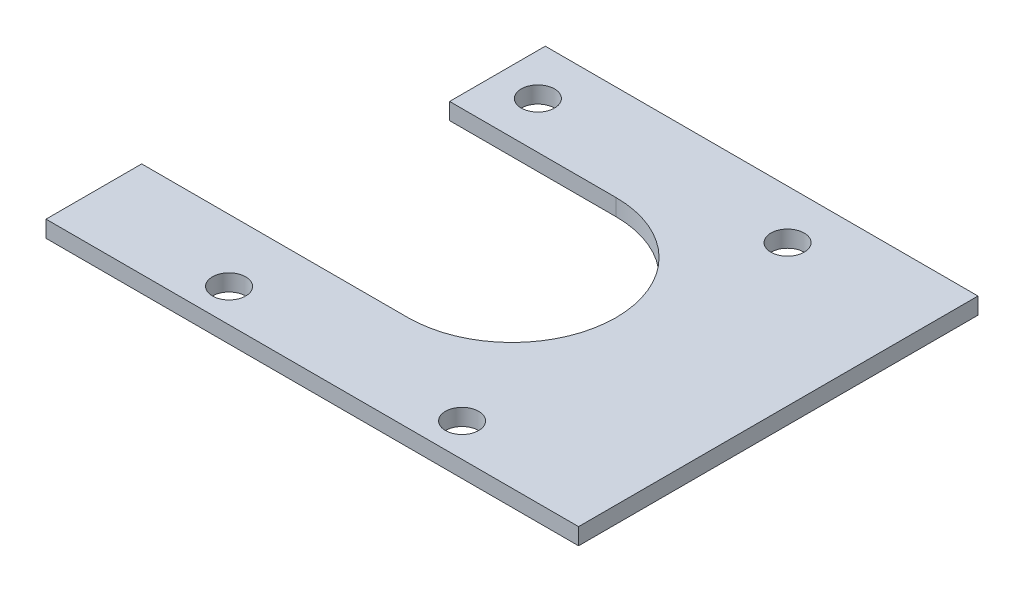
ISO-10303-21;
HEADER;
FILE_DESCRIPTION(('STEP AP214'),'2;1');
FILE_NAME('part.step','',(''),(''),'','','');
FILE_SCHEMA(('AUTOMOTIVE_DESIGN { 1 0 10303 214 1 1 1 1 }'));
ENDSEC;
DATA;
#1=APPLICATION_CONTEXT('core data for automotive mechanical design processes');
#2=APPLICATION_PROTOCOL_DEFINITION('international standard','automotive_design',2000,#1);
#3=PRODUCT_CONTEXT('',#1,'mechanical');
#4=PRODUCT('Part','Part','',(#3));
#5=PRODUCT_RELATED_PRODUCT_CATEGORY('part','',(#4));
#6=PRODUCT_DEFINITION_FORMATION('','',#4);
#7=PRODUCT_DEFINITION_CONTEXT('part definition',#1,'design');
#8=PRODUCT_DEFINITION('design','',#6,#7);
#9=PRODUCT_DEFINITION_SHAPE('','',#8);
#10=(LENGTH_UNIT() NAMED_UNIT(*) SI_UNIT(.MILLI.,.METRE.));
#11=(NAMED_UNIT(*) PLANE_ANGLE_UNIT() SI_UNIT($,.RADIAN.));
#12=(NAMED_UNIT(*) SI_UNIT($,.STERADIAN.) SOLID_ANGLE_UNIT());
#13=UNCERTAINTY_MEASURE_WITH_UNIT(LENGTH_MEASURE(1.E-05),#10,'distance_accuracy_value','');
#14=(GEOMETRIC_REPRESENTATION_CONTEXT(3) GLOBAL_UNCERTAINTY_ASSIGNED_CONTEXT((#13)) GLOBAL_UNIT_ASSIGNED_CONTEXT((#10,
#11,#12)) REPRESENTATION_CONTEXT('',''));
#15=CARTESIAN_POINT('',(0.,0.,0.));
#16=DIRECTION('',(0.,0.,1.));
#17=DIRECTION('',(1.,0.,0.));
#18=AXIS2_PLACEMENT_3D('',#15,#16,#17);
#19=CARTESIAN_POINT('',(25.4,1.5875,-19.05));
#20=DIRECTION('',(-1.,0.,0.));
#21=DIRECTION('',(0.,0.,1.));
#22=AXIS2_PLACEMENT_3D('',#19,#20,#21);
#23=PLANE('',#22);
#24=DIRECTION('',(0.,0.,-1.));
#25=VECTOR('',#24,1.);
#26=CARTESIAN_POINT('',(25.4,1.5875,-19.05));
#27=LINE('',#26,#25);
#28=CARTESIAN_POINT('',(25.4,1.5875,19.0499999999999));
#29=VERTEX_POINT('',#28);
#30=CARTESIAN_POINT('',(25.4,1.5875,-19.05));
#31=VERTEX_POINT('',#30);
#32=EDGE_CURVE('E93',#29,#31,#27,.T.);
#33=ORIENTED_EDGE('',*,*,#32,.F.);
#34=DIRECTION('',(0.,-1.,0.));
#35=VECTOR('',#34,1.);
#36=CARTESIAN_POINT('',(25.4,1.5875,19.0499999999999));
#37=LINE('',#36,#35);
#38=CARTESIAN_POINT('',(25.4,0.,19.0499999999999));
#39=VERTEX_POINT('',#38);
#40=EDGE_CURVE('E165',#29,#39,#37,.T.);
#41=ORIENTED_EDGE('',*,*,#40,.T.);
#42=DIRECTION('',(0.,0.,-1.));
#43=VECTOR('',#42,1.);
#44=CARTESIAN_POINT('',(25.4,0.,-19.05));
#45=LINE('',#44,#43);
#46=CARTESIAN_POINT('',(25.4,0.,-19.05));
#47=VERTEX_POINT('',#46);
#48=EDGE_CURVE('E134',#39,#47,#45,.T.);
#49=ORIENTED_EDGE('',*,*,#48,.T.);
#50=DIRECTION('',(0.,-1.,0.));
#51=VECTOR('',#50,1.);
#52=CARTESIAN_POINT('',(25.4,1.5875,-19.05));
#53=LINE('',#52,#51);
#54=EDGE_CURVE('E43',#31,#47,#53,.T.);
#55=ORIENTED_EDGE('',*,*,#54,.F.);
#56=EDGE_LOOP('',(#33,#41,#49,#55));
#57=FACE_BOUND('',#56,.T.);
#58=ADVANCED_FACE('F36',(#57),#23,.F.);
#59=CARTESIAN_POINT('',(25.4,1.5875,-19.05));
#60=DIRECTION('',(0.,0.,1.));
#61=DIRECTION('',(1.,0.,0.));
#62=AXIS2_PLACEMENT_3D('',#59,#60,#61);
#63=PLANE('',#62);
#64=DIRECTION('',(-1.,0.,0.));
#65=VECTOR('',#64,1.);
#66=CARTESIAN_POINT('',(25.4,0.,-19.05));
#67=LINE('',#66,#65);
#68=CARTESIAN_POINT('',(-15.875,0.,-19.05));
#69=VERTEX_POINT('',#68);
#70=EDGE_CURVE('E136',#47,#69,#67,.T.);
#71=ORIENTED_EDGE('',*,*,#70,.T.);
#72=DIRECTION('',(0.,-1.,0.));
#73=VECTOR('',#72,1.);
#74=CARTESIAN_POINT('',(-15.875,1.5875,-19.05));
#75=LINE('',#74,#73);
#76=CARTESIAN_POINT('',(-15.875,1.5875,-19.05));
#77=VERTEX_POINT('',#76);
#78=EDGE_CURVE('E151',#77,#69,#75,.T.);
#79=ORIENTED_EDGE('',*,*,#78,.F.);
#80=DIRECTION('',(-1.,0.,0.));
#81=VECTOR('',#80,1.);
#82=CARTESIAN_POINT('',(25.4,1.5875,-19.05));
#83=LINE('',#82,#81);
#84=EDGE_CURVE('E159',#31,#77,#83,.T.);
#85=ORIENTED_EDGE('',*,*,#84,.F.);
#86=ORIENTED_EDGE('',*,*,#54,.T.);
#87=EDGE_LOOP('',(#71,#79,#85,#86));
#88=FACE_BOUND('',#87,.T.);
#89=ADVANCED_FACE('F156',(#88),#63,.F.);
#90=CARTESIAN_POINT('',(-15.875,1.5875,-9.921875));
#91=DIRECTION('',(1.,0.,0.));
#92=DIRECTION('',(0.,0.,-1.));
#93=AXIS2_PLACEMENT_3D('',#90,#91,#92);
#94=PLANE('',#93);
#95=DIRECTION('',(0.,0.,1.));
#96=VECTOR('',#95,1.);
#97=CARTESIAN_POINT('',(-15.875,0.,-9.921875));
#98=LINE('',#97,#96);
#99=CARTESIAN_POINT('',(-15.875,0.,-9.921875));
#100=VERTEX_POINT('',#99);
#101=EDGE_CURVE('E139',#69,#100,#98,.T.);
#102=ORIENTED_EDGE('',*,*,#101,.T.);
#103=DIRECTION('',(0.,-1.,0.));
#104=VECTOR('',#103,1.);
#105=CARTESIAN_POINT('',(-15.875,1.5875,-9.921875));
#106=LINE('',#105,#104);
#107=CARTESIAN_POINT('',(-15.875,1.5875,-9.921875));
#108=VERTEX_POINT('',#107);
#109=EDGE_CURVE('E123',#108,#100,#106,.T.);
#110=ORIENTED_EDGE('',*,*,#109,.F.);
#111=DIRECTION('',(0.,0.,1.));
#112=VECTOR('',#111,1.);
#113=CARTESIAN_POINT('',(-15.875,1.5875,-9.921875));
#114=LINE('',#113,#112);
#115=EDGE_CURVE('E111',#77,#108,#114,.T.);
#116=ORIENTED_EDGE('',*,*,#115,.F.);
#117=ORIENTED_EDGE('',*,*,#78,.T.);
#118=EDGE_LOOP('',(#102,#110,#116,#117));
#119=FACE_BOUND('',#118,.T.);
#120=ADVANCED_FACE('F170',(#119),#94,.F.);
#121=CARTESIAN_POINT('',(0.,1.5875,-9.921875));
#122=DIRECTION('',(0.,0.,-1.));
#123=DIRECTION('',(-1.,0.,0.));
#124=AXIS2_PLACEMENT_3D('',#121,#122,#123);
#125=PLANE('',#124);
#126=DIRECTION('',(1.,0.,0.));
#127=VECTOR('',#126,1.);
#128=CARTESIAN_POINT('',(0.,0.,-9.921875));
#129=LINE('',#128,#127);
#130=CARTESIAN_POINT('',(0.,0.,-9.921875));
#131=VERTEX_POINT('',#130);
#132=EDGE_CURVE('E121',#100,#131,#129,.T.);
#133=ORIENTED_EDGE('',*,*,#132,.T.);
#134=DIRECTION('',(0.,-1.,0.));
#135=VECTOR('',#134,1.);
#136=CARTESIAN_POINT('',(0.,1.5875,-9.921875));
#137=LINE('',#136,#135);
#138=CARTESIAN_POINT('',(0.,1.5875,-9.921875));
#139=VERTEX_POINT('',#138);
#140=EDGE_CURVE('E118',#139,#131,#137,.T.);
#141=ORIENTED_EDGE('',*,*,#140,.F.);
#142=DIRECTION('',(1.,0.,0.));
#143=VECTOR('',#142,1.);
#144=CARTESIAN_POINT('',(0.,1.5875,-9.921875));
#145=LINE('',#144,#143);
#146=EDGE_CURVE('E103',#108,#139,#145,.T.);
#147=ORIENTED_EDGE('',*,*,#146,.F.);
#148=ORIENTED_EDGE('',*,*,#109,.T.);
#149=EDGE_LOOP('',(#133,#141,#147,#148));
#150=FACE_BOUND('',#149,.T.);
#151=ADVANCED_FACE('F119',(#150),#125,.F.);
#152=CARTESIAN_POINT('',(0.,1.5875,0.));
#153=DIRECTION('',(0.,-1.,0.));
#154=DIRECTION('',(0.,0.,-1.));
#155=AXIS2_PLACEMENT_3D('',#152,#153,#154);
#156=CYLINDRICAL_SURFACE('',#155,9.921875);
#157=CARTESIAN_POINT('',(0.,0.,0.));
#158=DIRECTION('',(0.,-1.,0.));
#159=DIRECTION('',(0.,0.,1.));
#160=AXIS2_PLACEMENT_3D('',#157,#158,#159);
#161=CIRCLE('',#160,9.921875);
#162=CARTESIAN_POINT('',(0.,0.,9.921875));
#163=VERTEX_POINT('',#162);
#164=EDGE_CURVE('E142',#131,#163,#161,.T.);
#165=ORIENTED_EDGE('',*,*,#164,.T.);
#166=DIRECTION('',(0.,-1.,0.));
#167=VECTOR('',#166,1.);
#168=CARTESIAN_POINT('',(0.,1.5875,9.921875));
#169=LINE('',#168,#167);
#170=CARTESIAN_POINT('',(0.,1.5875,9.921875));
#171=VERTEX_POINT('',#170);
#172=EDGE_CURVE('E124',#171,#163,#169,.T.);
#173=ORIENTED_EDGE('',*,*,#172,.F.);
#174=CARTESIAN_POINT('',(0.,1.5875,0.));
#175=DIRECTION('',(0.,-1.,0.));
#176=DIRECTION('',(0.,0.,1.));
#177=AXIS2_PLACEMENT_3D('',#174,#175,#176);
#178=CIRCLE('',#177,9.921875);
#179=EDGE_CURVE('E108',#139,#171,#178,.T.);
#180=ORIENTED_EDGE('',*,*,#179,.F.);
#181=ORIENTED_EDGE('',*,*,#140,.T.);
#182=EDGE_LOOP('',(#165,#173,#180,#181));
#183=FACE_BOUND('',#182,.T.);
#184=ADVANCED_FACE('F126',(#183),#156,.F.);
#185=CARTESIAN_POINT('',(0.,1.5875,9.921875));
#186=DIRECTION('',(0.,0.,1.));
#187=DIRECTION('',(1.,0.,0.));
#188=AXIS2_PLACEMENT_3D('',#185,#186,#187);
#189=PLANE('',#188);
#190=DIRECTION('',(-1.,0.,0.));
#191=VECTOR('',#190,1.);
#192=CARTESIAN_POINT('',(0.,0.,9.921875));
#193=LINE('',#192,#191);
#194=CARTESIAN_POINT('',(-25.4,0.,9.92187500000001));
#195=VERTEX_POINT('',#194);
#196=EDGE_CURVE('E85',#163,#195,#193,.T.);
#197=ORIENTED_EDGE('',*,*,#196,.T.);
#198=DIRECTION('',(0.,-1.,0.));
#199=VECTOR('',#198,1.);
#200=CARTESIAN_POINT('',(-25.4,1.5875,9.92187500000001));
#201=LINE('',#200,#199);
#202=CARTESIAN_POINT('',(-25.4,1.5875,9.92187500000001));
#203=VERTEX_POINT('',#202);
#204=EDGE_CURVE('E133',#203,#195,#201,.T.);
#205=ORIENTED_EDGE('',*,*,#204,.F.);
#206=DIRECTION('',(-1.,0.,0.));
#207=VECTOR('',#206,1.);
#208=CARTESIAN_POINT('',(0.,1.5875,9.921875));
#209=LINE('',#208,#207);
#210=EDGE_CURVE('E58',#171,#203,#209,.T.);
#211=ORIENTED_EDGE('',*,*,#210,.F.);
#212=ORIENTED_EDGE('',*,*,#172,.T.);
#213=EDGE_LOOP('',(#197,#205,#211,#212));
#214=FACE_BOUND('',#213,.T.);
#215=ADVANCED_FACE('F206',(#214),#189,.F.);
#216=CARTESIAN_POINT('',(-25.4,1.5875,9.92187500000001));
#217=DIRECTION('',(1.,0.,0.));
#218=DIRECTION('',(0.,0.,-1.));
#219=AXIS2_PLACEMENT_3D('',#216,#217,#218);
#220=PLANE('',#219);
#221=DIRECTION('',(0.,0.,1.));
#222=VECTOR('',#221,1.);
#223=CARTESIAN_POINT('',(-25.4,0.,9.92187500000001));
#224=LINE('',#223,#222);
#225=CARTESIAN_POINT('',(-25.4,0.,19.0499999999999));
#226=VERTEX_POINT('',#225);
#227=EDGE_CURVE('E145',#195,#226,#224,.T.);
#228=ORIENTED_EDGE('',*,*,#227,.T.);
#229=DIRECTION('',(0.,1.,0.));
#230=VECTOR('',#229,1.);
#231=CARTESIAN_POINT('',(-25.4,1.5875,19.0499999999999));
#232=LINE('',#231,#230);
#233=CARTESIAN_POINT('',(-25.4,1.5875,19.0499999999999));
#234=VERTEX_POINT('',#233);
#235=EDGE_CURVE('E50',#226,#234,#232,.T.);
#236=ORIENTED_EDGE('',*,*,#235,.T.);
#237=DIRECTION('',(0.,0.,1.));
#238=VECTOR('',#237,1.);
#239=CARTESIAN_POINT('',(-25.4,1.5875,9.92187500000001));
#240=LINE('',#239,#238);
#241=EDGE_CURVE('E128',#203,#234,#240,.T.);
#242=ORIENTED_EDGE('',*,*,#241,.F.);
#243=ORIENTED_EDGE('',*,*,#204,.T.);
#244=EDGE_LOOP('',(#228,#236,#242,#243));
#245=FACE_BOUND('',#244,.T.);
#246=ADVANCED_FACE('F204',(#245),#220,.F.);
#247=CARTESIAN_POINT('',(0.,1.5875,0.));
#248=DIRECTION('',(0.,1.,0.));
#249=DIRECTION('',(0.,0.,1.));
#250=AXIS2_PLACEMENT_3D('',#247,#248,#249);
#251=PLANE('',#250);
#252=DIRECTION('',(-1.,0.,0.));
#253=VECTOR('',#252,1.);
#254=CARTESIAN_POINT('',(31.7053948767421,1.5875,19.0499999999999));
#255=LINE('',#254,#253);
#256=EDGE_CURVE('E199',#29,#234,#255,.T.);
#257=ORIENTED_EDGE('',*,*,#256,.F.);
#258=ORIENTED_EDGE('',*,*,#32,.T.);
#259=ORIENTED_EDGE('',*,*,#84,.T.);
#260=ORIENTED_EDGE('',*,*,#115,.T.);
#261=ORIENTED_EDGE('',*,*,#146,.T.);
#262=ORIENTED_EDGE('',*,*,#179,.T.);
#263=ORIENTED_EDGE('',*,*,#210,.T.);
#264=ORIENTED_EDGE('',*,*,#241,.T.);
#265=EDGE_LOOP('',(#257,#258,#259,#260,#261,#262,#263,#264));
#266=FACE_BOUND('',#265,.T.);
#267=CARTESIAN_POINT('',(-11.1125,1.5875,15.875));
#268=DIRECTION('',(0.,1.,0.));
#269=DIRECTION('',(0.,0.,1.));
#270=AXIS2_PLACEMENT_3D('',#267,#268,#269);
#271=CIRCLE('',#270,1.5875);
#272=CARTESIAN_POINT('',(-11.1125,1.5875,17.4625));
#273=VERTEX_POINT('',#272);
#274=EDGE_CURVE('E192',#273,#273,#271,.T.);
#275=ORIENTED_EDGE('',*,*,#274,.F.);
#276=EDGE_LOOP('',(#275));
#277=FACE_BOUND('',#276,.T.);
#278=CARTESIAN_POINT('',(11.1125,1.5875,15.875));
#279=DIRECTION('',(0.,1.,0.));
#280=DIRECTION('',(0.,0.,1.));
#281=AXIS2_PLACEMENT_3D('',#278,#279,#280);
#282=CIRCLE('',#281,1.5875);
#283=CARTESIAN_POINT('',(11.1125,1.5875,17.4625));
#284=VERTEX_POINT('',#283);
#285=EDGE_CURVE('E186',#284,#284,#282,.T.);
#286=ORIENTED_EDGE('',*,*,#285,.F.);
#287=EDGE_LOOP('',(#286));
#288=FACE_BOUND('',#287,.T.);
#289=CARTESIAN_POINT('',(-11.90625,1.5875,-14.3764));
#290=DIRECTION('',(0.,1.,0.));
#291=DIRECTION('',(0.,0.,1.));
#292=AXIS2_PLACEMENT_3D('',#289,#290,#291);
#293=CIRCLE('',#292,1.5875);
#294=CARTESIAN_POINT('',(-11.90625,1.5875,-12.7889));
#295=VERTEX_POINT('',#294);
#296=EDGE_CURVE('E180',#295,#295,#293,.T.);
#297=ORIENTED_EDGE('',*,*,#296,.F.);
#298=EDGE_LOOP('',(#297));
#299=FACE_BOUND('',#298,.T.);
#300=CARTESIAN_POINT('',(11.90625,1.5875,-14.3764));
#301=DIRECTION('',(0.,1.,0.));
#302=DIRECTION('',(0.,0.,1.));
#303=AXIS2_PLACEMENT_3D('',#300,#301,#302);
#304=CIRCLE('',#303,1.5875);
#305=CARTESIAN_POINT('',(11.90625,1.5875,-12.7889));
#306=VERTEX_POINT('',#305);
#307=EDGE_CURVE('E174',#306,#306,#304,.T.);
#308=ORIENTED_EDGE('',*,*,#307,.F.);
#309=EDGE_LOOP('',(#308));
#310=FACE_BOUND('',#309,.T.);
#311=ADVANCED_FACE('F105',(#266,#277,#288,#299,#310),#251,.T.);
#312=CARTESIAN_POINT('',(0.,0.,0.));
#313=DIRECTION('',(0.,1.,0.));
#314=DIRECTION('',(0.,0.,1.));
#315=AXIS2_PLACEMENT_3D('',#312,#313,#314);
#316=PLANE('',#315);
#317=CARTESIAN_POINT('',(-11.1125,0.,15.875));
#318=DIRECTION('',(0.,1.,0.));
#319=DIRECTION('',(0.,0.,1.));
#320=AXIS2_PLACEMENT_3D('',#317,#318,#319);
#321=CIRCLE('',#320,1.5875);
#322=CARTESIAN_POINT('',(-11.1125,0.,17.4625));
#323=VERTEX_POINT('',#322);
#324=EDGE_CURVE('E189',#323,#323,#321,.T.);
#325=ORIENTED_EDGE('',*,*,#324,.T.);
#326=EDGE_LOOP('',(#325));
#327=FACE_BOUND('',#326,.T.);
#328=CARTESIAN_POINT('',(11.1125,0.,15.875));
#329=DIRECTION('',(0.,1.,0.));
#330=DIRECTION('',(0.,0.,1.));
#331=AXIS2_PLACEMENT_3D('',#328,#329,#330);
#332=CIRCLE('',#331,1.5875);
#333=CARTESIAN_POINT('',(11.1125,0.,17.4625));
#334=VERTEX_POINT('',#333);
#335=EDGE_CURVE('E183',#334,#334,#332,.T.);
#336=ORIENTED_EDGE('',*,*,#335,.T.);
#337=EDGE_LOOP('',(#336));
#338=FACE_BOUND('',#337,.T.);
#339=CARTESIAN_POINT('',(-11.90625,0.,-14.3764));
#340=DIRECTION('',(0.,1.,0.));
#341=DIRECTION('',(0.,0.,1.));
#342=AXIS2_PLACEMENT_3D('',#339,#340,#341);
#343=CIRCLE('',#342,1.5875);
#344=CARTESIAN_POINT('',(-11.90625,0.,-12.7889));
#345=VERTEX_POINT('',#344);
#346=EDGE_CURVE('E177',#345,#345,#343,.T.);
#347=ORIENTED_EDGE('',*,*,#346,.T.);
#348=EDGE_LOOP('',(#347));
#349=FACE_BOUND('',#348,.T.);
#350=CARTESIAN_POINT('',(11.90625,0.,-14.3764));
#351=DIRECTION('',(0.,1.,0.));
#352=DIRECTION('',(0.,0.,1.));
#353=AXIS2_PLACEMENT_3D('',#350,#351,#352);
#354=CIRCLE('',#353,1.5875);
#355=CARTESIAN_POINT('',(11.90625,0.,-12.7889));
#356=VERTEX_POINT('',#355);
#357=EDGE_CURVE('E137',#356,#356,#354,.T.);
#358=ORIENTED_EDGE('',*,*,#357,.T.);
#359=EDGE_LOOP('',(#358));
#360=FACE_BOUND('',#359,.T.);
#361=ORIENTED_EDGE('',*,*,#48,.F.);
#362=DIRECTION('',(-1.,0.,0.));
#363=VECTOR('',#362,1.);
#364=CARTESIAN_POINT('',(0.,0.,19.0499999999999));
#365=LINE('',#364,#363);
#366=EDGE_CURVE('E11',#39,#226,#365,.T.);
#367=ORIENTED_EDGE('',*,*,#366,.T.);
#368=ORIENTED_EDGE('',*,*,#227,.F.);
#369=ORIENTED_EDGE('',*,*,#196,.F.);
#370=ORIENTED_EDGE('',*,*,#164,.F.);
#371=ORIENTED_EDGE('',*,*,#132,.F.);
#372=ORIENTED_EDGE('',*,*,#101,.F.);
#373=ORIENTED_EDGE('',*,*,#70,.F.);
#374=EDGE_LOOP('',(#361,#367,#368,#369,#370,#371,#372,#373));
#375=FACE_BOUND('',#374,.T.);
#376=ADVANCED_FACE('F168',(#327,#338,#349,#360,#375),#316,.F.);
#377=CARTESIAN_POINT('',(11.90625,0.,-14.3764));
#378=DIRECTION('',(0.,1.,0.));
#379=DIRECTION('',(0.,0.,1.));
#380=AXIS2_PLACEMENT_3D('',#377,#378,#379);
#381=CYLINDRICAL_SURFACE('',#380,1.5875);
#382=ORIENTED_EDGE('',*,*,#357,.F.);
#383=EDGE_LOOP('',(#382));
#384=FACE_BOUND('',#383,.T.);
#385=ORIENTED_EDGE('',*,*,#307,.T.);
#386=EDGE_LOOP('',(#385));
#387=FACE_BOUND('',#386,.T.);
#388=ADVANCED_FACE('F244',(#384,#387),#381,.F.);
#389=CARTESIAN_POINT('',(-11.90625,0.,-14.3764));
#390=DIRECTION('',(0.,1.,0.));
#391=DIRECTION('',(0.,0.,1.));
#392=AXIS2_PLACEMENT_3D('',#389,#390,#391);
#393=CYLINDRICAL_SURFACE('',#392,1.5875);
#394=ORIENTED_EDGE('',*,*,#346,.F.);
#395=EDGE_LOOP('',(#394));
#396=FACE_BOUND('',#395,.T.);
#397=ORIENTED_EDGE('',*,*,#296,.T.);
#398=EDGE_LOOP('',(#397));
#399=FACE_BOUND('',#398,.T.);
#400=ADVANCED_FACE('F249',(#396,#399),#393,.F.);
#401=CARTESIAN_POINT('',(11.1125,0.,15.875));
#402=DIRECTION('',(0.,1.,0.));
#403=DIRECTION('',(0.,0.,1.));
#404=AXIS2_PLACEMENT_3D('',#401,#402,#403);
#405=CYLINDRICAL_SURFACE('',#404,1.5875);
#406=ORIENTED_EDGE('',*,*,#335,.F.);
#407=EDGE_LOOP('',(#406));
#408=FACE_BOUND('',#407,.T.);
#409=ORIENTED_EDGE('',*,*,#285,.T.);
#410=EDGE_LOOP('',(#409));
#411=FACE_BOUND('',#410,.T.);
#412=ADVANCED_FACE('F261',(#408,#411),#405,.F.);
#413=CARTESIAN_POINT('',(-11.1125,0.,15.875));
#414=DIRECTION('',(0.,1.,0.));
#415=DIRECTION('',(0.,0.,1.));
#416=AXIS2_PLACEMENT_3D('',#413,#414,#415);
#417=CYLINDRICAL_SURFACE('',#416,1.5875);
#418=ORIENTED_EDGE('',*,*,#324,.F.);
#419=EDGE_LOOP('',(#418));
#420=FACE_BOUND('',#419,.T.);
#421=ORIENTED_EDGE('',*,*,#274,.T.);
#422=EDGE_LOOP('',(#421));
#423=FACE_BOUND('',#422,.T.);
#424=ADVANCED_FACE('F271',(#420,#423),#417,.F.);
#425=CARTESIAN_POINT('',(31.7053948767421,0.,19.0499999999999));
#426=DIRECTION('',(0.,0.,-1.));
#427=DIRECTION('',(-1.,0.,0.));
#428=AXIS2_PLACEMENT_3D('',#425,#426,#427);
#429=PLANE('',#428);
#430=ORIENTED_EDGE('',*,*,#256,.T.);
#431=ORIENTED_EDGE('',*,*,#235,.F.);
#432=ORIENTED_EDGE('',*,*,#366,.F.);
#433=ORIENTED_EDGE('',*,*,#40,.F.);
#434=EDGE_LOOP('',(#430,#431,#432,#433));
#435=FACE_BOUND('',#434,.T.);
#436=ADVANCED_FACE('F201',(#435),#429,.F.);
#437=CLOSED_SHELL('',(#58,#89,#120,#151,#184,#215,#246,#311,#376,#388,#400,#412,#424,#436));
#438=MANIFOLD_SOLID_BREP('B2',#437);
#439=ADVANCED_BREP_SHAPE_REPRESENTATION('',(#18,#438),#14);
#440=SHAPE_DEFINITION_REPRESENTATION(#9,#439);
ENDSEC;
END-ISO-10303-21;
